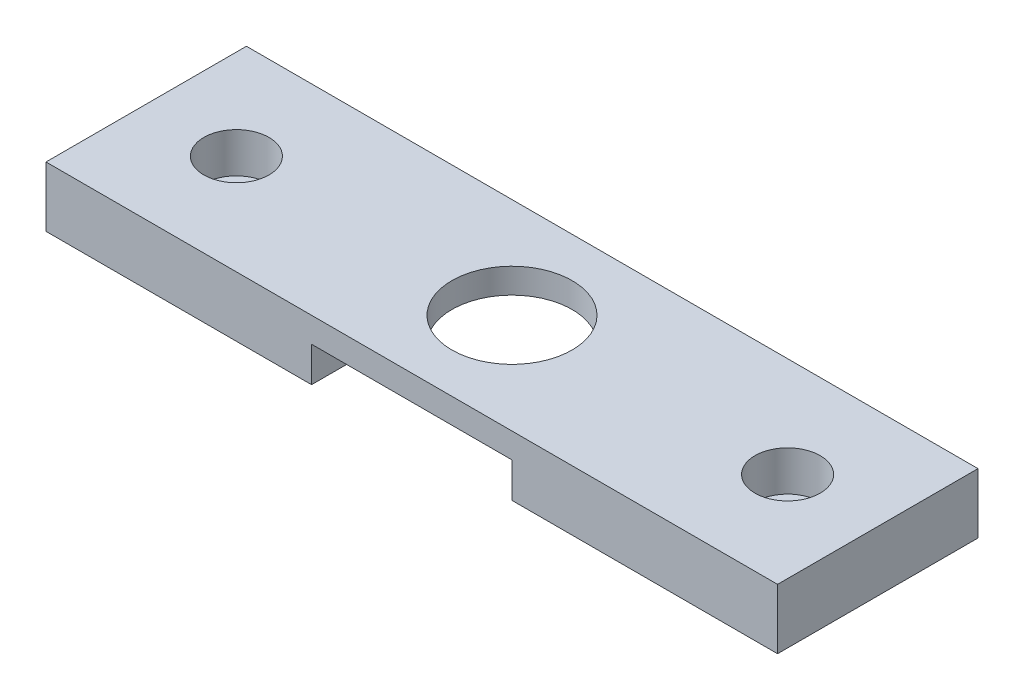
ISO-10303-21;
HEADER;
FILE_DESCRIPTION(('STEP AP214'),'2;1');
FILE_NAME('part.step','',(''),(''),'','','');
FILE_SCHEMA(('AUTOMOTIVE_DESIGN { 1 0 10303 214 1 1 1 1 }'));
ENDSEC;
DATA;
#1=APPLICATION_CONTEXT('core data for automotive mechanical design processes');
#2=APPLICATION_PROTOCOL_DEFINITION('international standard','automotive_design',2000,#1);
#3=PRODUCT_CONTEXT('',#1,'mechanical');
#4=PRODUCT('Part','Part','',(#3));
#5=PRODUCT_RELATED_PRODUCT_CATEGORY('part','',(#4));
#6=PRODUCT_DEFINITION_FORMATION('','',#4);
#7=PRODUCT_DEFINITION_CONTEXT('part definition',#1,'design');
#8=PRODUCT_DEFINITION('design','',#6,#7);
#9=PRODUCT_DEFINITION_SHAPE('','',#8);
#10=(LENGTH_UNIT() NAMED_UNIT(*) SI_UNIT(.MILLI.,.METRE.));
#11=(NAMED_UNIT(*) PLANE_ANGLE_UNIT() SI_UNIT($,.RADIAN.));
#12=(NAMED_UNIT(*) SI_UNIT($,.STERADIAN.) SOLID_ANGLE_UNIT());
#13=UNCERTAINTY_MEASURE_WITH_UNIT(LENGTH_MEASURE(1.E-05),#10,'distance_accuracy_value','');
#14=(GEOMETRIC_REPRESENTATION_CONTEXT(3) GLOBAL_UNCERTAINTY_ASSIGNED_CONTEXT((#13)) GLOBAL_UNIT_ASSIGNED_CONTEXT((#10,
#11,#12)) REPRESENTATION_CONTEXT('',''));
#15=CARTESIAN_POINT('',(0.,0.,0.));
#16=DIRECTION('',(0.,0.,1.));
#17=DIRECTION('',(1.,0.,0.));
#18=AXIS2_PLACEMENT_3D('',#15,#16,#17);
#19=CARTESIAN_POINT('',(-55.,12.,0.));
#20=DIRECTION('',(0.,1.,0.));
#21=DIRECTION('',(0.,0.,1.));
#22=AXIS2_PLACEMENT_3D('',#19,#20,#21);
#23=CYLINDRICAL_SURFACE('',#22,4.2);
#24=CARTESIAN_POINT('',(-55.,0.,0.));
#25=DIRECTION('',(0.,1.,0.));
#26=DIRECTION('',(0.,0.,1.));
#27=AXIS2_PLACEMENT_3D('',#24,#25,#26);
#28=CIRCLE('',#27,4.2);
#29=CARTESIAN_POINT('',(-55.,0.,4.2));
#30=VERTEX_POINT('',#29);
#31=EDGE_CURVE('E126',#30,#30,#28,.F.);
#32=ORIENTED_EDGE('',*,*,#31,.T.);
#33=EDGE_LOOP('',(#32));
#34=FACE_BOUND('',#33,.T.);
#35=CARTESIAN_POINT('',(-55.,4.,0.));
#36=DIRECTION('',(0.,1.,0.));
#37=DIRECTION('',(0.,0.,1.));
#38=AXIS2_PLACEMENT_3D('',#35,#36,#37);
#39=CIRCLE('',#38,4.2);
#40=CARTESIAN_POINT('',(-55.,4.,4.2));
#41=VERTEX_POINT('',#40);
#42=EDGE_CURVE('E20',#41,#41,#39,.T.);
#43=ORIENTED_EDGE('',*,*,#42,.T.);
#44=EDGE_LOOP('',(#43));
#45=FACE_BOUND('',#44,.T.);
#46=ADVANCED_FACE('F17',(#34,#45),#23,.F.);
#47=CARTESIAN_POINT('',(55.,12.,0.));
#48=DIRECTION('',(0.,1.,0.));
#49=DIRECTION('',(0.,0.,1.));
#50=AXIS2_PLACEMENT_3D('',#47,#48,#49);
#51=CYLINDRICAL_SURFACE('',#50,4.2);
#52=CARTESIAN_POINT('',(55.,0.,0.));
#53=DIRECTION('',(0.,1.,0.));
#54=DIRECTION('',(0.,0.,1.));
#55=AXIS2_PLACEMENT_3D('',#52,#53,#54);
#56=CIRCLE('',#55,4.2);
#57=CARTESIAN_POINT('',(55.,0.,4.2));
#58=VERTEX_POINT('',#57);
#59=EDGE_CURVE('E124',#58,#58,#56,.F.);
#60=ORIENTED_EDGE('',*,*,#59,.T.);
#61=EDGE_LOOP('',(#60));
#62=FACE_BOUND('',#61,.T.);
#63=CARTESIAN_POINT('',(55.,4.,0.));
#64=DIRECTION('',(0.,1.,0.));
#65=DIRECTION('',(0.,0.,1.));
#66=AXIS2_PLACEMENT_3D('',#63,#64,#65);
#67=CIRCLE('',#66,4.2);
#68=CARTESIAN_POINT('',(55.,4.,4.2));
#69=VERTEX_POINT('',#68);
#70=EDGE_CURVE('E148',#69,#69,#67,.T.);
#71=ORIENTED_EDGE('',*,*,#70,.T.);
#72=EDGE_LOOP('',(#71));
#73=FACE_BOUND('',#72,.T.);
#74=ADVANCED_FACE('F159',(#62,#73),#51,.F.);
#75=CARTESIAN_POINT('',(-50.8,4.,0.));
#76=DIRECTION('',(0.,-1.,0.));
#77=DIRECTION('',(0.,0.,-1.));
#78=AXIS2_PLACEMENT_3D('',#75,#76,#77);
#79=PLANE('',#78);
#80=CARTESIAN_POINT('',(-55.,4.,0.));
#81=DIRECTION('',(0.,1.,0.));
#82=DIRECTION('',(0.,0.,1.));
#83=AXIS2_PLACEMENT_3D('',#80,#81,#82);
#84=CIRCLE('',#83,6.5);
#85=CARTESIAN_POINT('',(-55.,4.,6.50000000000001));
#86=VERTEX_POINT('',#85);
#87=EDGE_CURVE('E140',#86,#86,#84,.T.);
#88=ORIENTED_EDGE('',*,*,#87,.T.);
#89=EDGE_LOOP('',(#88));
#90=FACE_BOUND('',#89,.T.);
#91=ORIENTED_EDGE('',*,*,#42,.F.);
#92=EDGE_LOOP('',(#91));
#93=FACE_BOUND('',#92,.T.);
#94=ADVANCED_FACE('F156',(#90,#93),#79,.F.);
#95=CARTESIAN_POINT('',(59.2,4.,0.));
#96=DIRECTION('',(0.,-1.,0.));
#97=DIRECTION('',(0.,0.,-1.));
#98=AXIS2_PLACEMENT_3D('',#95,#96,#97);
#99=PLANE('',#98);
#100=CARTESIAN_POINT('',(55.,4.,0.));
#101=DIRECTION('',(0.,1.,0.));
#102=DIRECTION('',(0.,0.,1.));
#103=AXIS2_PLACEMENT_3D('',#100,#101,#102);
#104=CIRCLE('',#103,6.5);
#105=CARTESIAN_POINT('',(55.,4.,6.50000000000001));
#106=VERTEX_POINT('',#105);
#107=EDGE_CURVE('E94',#106,#106,#104,.T.);
#108=ORIENTED_EDGE('',*,*,#107,.T.);
#109=EDGE_LOOP('',(#108));
#110=FACE_BOUND('',#109,.T.);
#111=ORIENTED_EDGE('',*,*,#70,.F.);
#112=EDGE_LOOP('',(#111));
#113=FACE_BOUND('',#112,.T.);
#114=ADVANCED_FACE('F158',(#110,#113),#99,.F.);
#115=CARTESIAN_POINT('',(-20.,-7.,-20.));
#116=DIRECTION('',(-1.,0.,0.));
#117=DIRECTION('',(0.,0.,1.));
#118=AXIS2_PLACEMENT_3D('',#115,#116,#117);
#119=PLANE('',#118);
#120=DIRECTION('',(0.,0.,1.));
#121=VECTOR('',#120,1.);
#122=CARTESIAN_POINT('',(-20.,7.,-20.));
#123=LINE('',#122,#121);
#124=CARTESIAN_POINT('',(-20.,7.,-20.));
#125=VERTEX_POINT('',#124);
#126=CARTESIAN_POINT('',(-20.,7.,20.));
#127=VERTEX_POINT('',#126);
#128=EDGE_CURVE('E118',#125,#127,#123,.T.);
#129=ORIENTED_EDGE('',*,*,#128,.T.);
#130=DIRECTION('',(0.,1.,0.));
#131=VECTOR('',#130,1.);
#132=CARTESIAN_POINT('',(-20.,12.,20.));
#133=LINE('',#132,#131);
#134=CARTESIAN_POINT('',(-20.,0.,20.));
#135=VERTEX_POINT('',#134);
#136=EDGE_CURVE('E223',#127,#135,#133,.F.);
#137=ORIENTED_EDGE('',*,*,#136,.T.);
#138=DIRECTION('',(0.,0.,1.));
#139=VECTOR('',#138,1.);
#140=CARTESIAN_POINT('',(-20.,0.,0.));
#141=LINE('',#140,#139);
#142=CARTESIAN_POINT('',(-20.,0.,-20.));
#143=VERTEX_POINT('',#142);
#144=EDGE_CURVE('E79',#135,#143,#141,.F.);
#145=ORIENTED_EDGE('',*,*,#144,.T.);
#146=DIRECTION('',(0.,1.,0.));
#147=VECTOR('',#146,1.);
#148=CARTESIAN_POINT('',(-20.,12.,-20.));
#149=LINE('',#148,#147);
#150=EDGE_CURVE('E114',#143,#125,#149,.T.);
#151=ORIENTED_EDGE('',*,*,#150,.T.);
#152=EDGE_LOOP('',(#129,#137,#145,#151));
#153=FACE_BOUND('',#152,.T.);
#154=ADVANCED_FACE('F167',(#153),#119,.F.);
#155=CARTESIAN_POINT('',(0.,0.,0.));
#156=DIRECTION('',(0.,1.,0.));
#157=DIRECTION('',(0.,0.,1.));
#158=AXIS2_PLACEMENT_3D('',#155,#156,#157);
#159=PLANE('',#158);
#160=ORIENTED_EDGE('',*,*,#144,.F.);
#161=DIRECTION('',(-1.,0.,0.));
#162=VECTOR('',#161,1.);
#163=CARTESIAN_POINT('',(-73.,0.,20.));
#164=LINE('',#163,#162);
#165=CARTESIAN_POINT('',(-73.,0.,20.));
#166=VERTEX_POINT('',#165);
#167=EDGE_CURVE('E234',#135,#166,#164,.T.);
#168=ORIENTED_EDGE('',*,*,#167,.T.);
#169=DIRECTION('',(0.,0.,-1.));
#170=VECTOR('',#169,1.);
#171=CARTESIAN_POINT('',(-73.,0.,-20.));
#172=LINE('',#171,#170);
#173=CARTESIAN_POINT('',(-73.,0.,-20.));
#174=VERTEX_POINT('',#173);
#175=EDGE_CURVE('E235',#166,#174,#172,.T.);
#176=ORIENTED_EDGE('',*,*,#175,.T.);
#177=DIRECTION('',(1.,0.,0.));
#178=VECTOR('',#177,1.);
#179=CARTESIAN_POINT('',(-73.,0.,-20.));
#180=LINE('',#179,#178);
#181=EDGE_CURVE('E112',#174,#143,#180,.T.);
#182=ORIENTED_EDGE('',*,*,#181,.T.);
#183=EDGE_LOOP('',(#160,#168,#176,#182));
#184=FACE_BOUND('',#183,.T.);
#185=ORIENTED_EDGE('',*,*,#31,.F.);
#186=EDGE_LOOP('',(#185));
#187=FACE_BOUND('',#186,.T.);
#188=ADVANCED_FACE('F213',(#184,#187),#159,.F.);
#189=CARTESIAN_POINT('',(0.,0.,0.));
#190=DIRECTION('',(0.,1.,0.));
#191=DIRECTION('',(0.,0.,1.));
#192=AXIS2_PLACEMENT_3D('',#189,#190,#191);
#193=PLANE('',#192);
#194=DIRECTION('',(0.,0.,-1.));
#195=VECTOR('',#194,1.);
#196=CARTESIAN_POINT('',(20.,0.,-20.));
#197=LINE('',#196,#195);
#198=CARTESIAN_POINT('',(20.,0.,20.));
#199=VERTEX_POINT('',#198);
#200=CARTESIAN_POINT('',(20.,0.,-20.));
#201=VERTEX_POINT('',#200);
#202=EDGE_CURVE('E101',#199,#201,#197,.T.);
#203=ORIENTED_EDGE('',*,*,#202,.T.);
#204=DIRECTION('',(1.,0.,0.));
#205=VECTOR('',#204,1.);
#206=CARTESIAN_POINT('',(-73.,0.,-20.));
#207=LINE('',#206,#205);
#208=CARTESIAN_POINT('',(73.,0.,-20.));
#209=VERTEX_POINT('',#208);
#210=EDGE_CURVE('E97',#201,#209,#207,.T.);
#211=ORIENTED_EDGE('',*,*,#210,.T.);
#212=DIRECTION('',(0.,0.,1.));
#213=VECTOR('',#212,1.);
#214=CARTESIAN_POINT('',(73.,0.,-20.));
#215=LINE('',#214,#213);
#216=CARTESIAN_POINT('',(73.,0.,20.));
#217=VERTEX_POINT('',#216);
#218=EDGE_CURVE('E84',#209,#217,#215,.T.);
#219=ORIENTED_EDGE('',*,*,#218,.T.);
#220=DIRECTION('',(-1.,0.,0.));
#221=VECTOR('',#220,1.);
#222=CARTESIAN_POINT('',(-73.,0.,20.));
#223=LINE('',#222,#221);
#224=EDGE_CURVE('E245',#217,#199,#223,.T.);
#225=ORIENTED_EDGE('',*,*,#224,.T.);
#226=EDGE_LOOP('',(#203,#211,#219,#225));
#227=FACE_BOUND('',#226,.T.);
#228=ORIENTED_EDGE('',*,*,#59,.F.);
#229=EDGE_LOOP('',(#228));
#230=FACE_BOUND('',#229,.T.);
#231=ADVANCED_FACE('F98',(#227,#230),#193,.F.);
#232=CARTESIAN_POINT('',(20.,-7.,-20.));
#233=DIRECTION('',(1.,0.,0.));
#234=DIRECTION('',(0.,0.,-1.));
#235=AXIS2_PLACEMENT_3D('',#232,#233,#234);
#236=PLANE('',#235);
#237=DIRECTION('',(0.,0.,1.));
#238=VECTOR('',#237,1.);
#239=CARTESIAN_POINT('',(20.,7.,-20.));
#240=LINE('',#239,#238);
#241=CARTESIAN_POINT('',(20.,7.,20.));
#242=VERTEX_POINT('',#241);
#243=CARTESIAN_POINT('',(20.,7.,-20.));
#244=VERTEX_POINT('',#243);
#245=EDGE_CURVE('E121',#242,#244,#240,.F.);
#246=ORIENTED_EDGE('',*,*,#245,.T.);
#247=DIRECTION('',(0.,1.,0.));
#248=VECTOR('',#247,1.);
#249=CARTESIAN_POINT('',(20.,12.,-20.));
#250=LINE('',#249,#248);
#251=EDGE_CURVE('E106',#244,#201,#250,.F.);
#252=ORIENTED_EDGE('',*,*,#251,.T.);
#253=ORIENTED_EDGE('',*,*,#202,.F.);
#254=DIRECTION('',(0.,1.,0.));
#255=VECTOR('',#254,1.);
#256=CARTESIAN_POINT('',(20.,12.,20.));
#257=LINE('',#256,#255);
#258=EDGE_CURVE('E231',#199,#242,#257,.T.);
#259=ORIENTED_EDGE('',*,*,#258,.T.);
#260=EDGE_LOOP('',(#246,#252,#253,#259));
#261=FACE_BOUND('',#260,.T.);
#262=ADVANCED_FACE('F206',(#261),#236,.F.);
#263=CARTESIAN_POINT('',(-20.,7.,-20.));
#264=DIRECTION('',(0.,1.,0.));
#265=DIRECTION('',(0.,0.,1.));
#266=AXIS2_PLACEMENT_3D('',#263,#264,#265);
#267=PLANE('',#266);
#268=CARTESIAN_POINT('',(0.,7.,0.));
#269=DIRECTION('',(0.,1.,0.));
#270=DIRECTION('',(0.,0.,1.));
#271=AXIS2_PLACEMENT_3D('',#268,#269,#270);
#272=CIRCLE('',#271,12.);
#273=CARTESIAN_POINT('',(0.,7.,12.));
#274=VERTEX_POINT('',#273);
#275=EDGE_CURVE('E120',#274,#274,#272,.T.);
#276=ORIENTED_EDGE('',*,*,#275,.T.);
#277=EDGE_LOOP('',(#276));
#278=FACE_BOUND('',#277,.T.);
#279=ORIENTED_EDGE('',*,*,#128,.F.);
#280=DIRECTION('',(1.,0.,0.));
#281=VECTOR('',#280,1.);
#282=CARTESIAN_POINT('',(-73.,7.,-20.));
#283=LINE('',#282,#281);
#284=EDGE_CURVE('E244',#125,#244,#283,.T.);
#285=ORIENTED_EDGE('',*,*,#284,.T.);
#286=ORIENTED_EDGE('',*,*,#245,.F.);
#287=DIRECTION('',(-1.,0.,0.));
#288=VECTOR('',#287,1.);
#289=CARTESIAN_POINT('',(-73.,7.,20.));
#290=LINE('',#289,#288);
#291=EDGE_CURVE('E137',#242,#127,#290,.T.);
#292=ORIENTED_EDGE('',*,*,#291,.T.);
#293=EDGE_LOOP('',(#279,#285,#286,#292));
#294=FACE_BOUND('',#293,.T.);
#295=ADVANCED_FACE('F202',(#278,#294),#267,.F.);
#296=CARTESIAN_POINT('',(0.,0.,0.));
#297=DIRECTION('',(0.,1.,0.));
#298=DIRECTION('',(0.,0.,1.));
#299=AXIS2_PLACEMENT_3D('',#296,#297,#298);
#300=CYLINDRICAL_SURFACE('',#299,12.);
#301=CARTESIAN_POINT('',(0.,12.,0.));
#302=DIRECTION('',(0.,1.,0.));
#303=DIRECTION('',(0.,0.,1.));
#304=AXIS2_PLACEMENT_3D('',#301,#302,#303);
#305=CIRCLE('',#304,12.);
#306=CARTESIAN_POINT('',(0.,12.,12.));
#307=VERTEX_POINT('',#306);
#308=EDGE_CURVE('E134',#307,#307,#305,.F.);
#309=ORIENTED_EDGE('',*,*,#308,.F.);
#310=EDGE_LOOP('',(#309));
#311=FACE_BOUND('',#310,.T.);
#312=ORIENTED_EDGE('',*,*,#275,.F.);
#313=EDGE_LOOP('',(#312));
#314=FACE_BOUND('',#313,.T.);
#315=ADVANCED_FACE('F198',(#311,#314),#300,.F.);
#316=CARTESIAN_POINT('',(-55.,12.,0.));
#317=DIRECTION('',(0.,1.,0.));
#318=DIRECTION('',(0.,0.,1.));
#319=AXIS2_PLACEMENT_3D('',#316,#317,#318);
#320=CYLINDRICAL_SURFACE('',#319,6.5);
#321=CARTESIAN_POINT('',(-55.,12.,0.));
#322=DIRECTION('',(0.,1.,0.));
#323=DIRECTION('',(0.,0.,1.));
#324=AXIS2_PLACEMENT_3D('',#321,#322,#323);
#325=CIRCLE('',#324,6.5);
#326=CARTESIAN_POINT('',(-55.,12.,6.50000000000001));
#327=VERTEX_POINT('',#326);
#328=EDGE_CURVE('E131',#327,#327,#325,.F.);
#329=ORIENTED_EDGE('',*,*,#328,.F.);
#330=EDGE_LOOP('',(#329));
#331=FACE_BOUND('',#330,.T.);
#332=ORIENTED_EDGE('',*,*,#87,.F.);
#333=EDGE_LOOP('',(#332));
#334=FACE_BOUND('',#333,.T.);
#335=ADVANCED_FACE('F194',(#331,#334),#320,.F.);
#336=CARTESIAN_POINT('',(55.,12.,0.));
#337=DIRECTION('',(0.,1.,0.));
#338=DIRECTION('',(0.,0.,1.));
#339=AXIS2_PLACEMENT_3D('',#336,#337,#338);
#340=CYLINDRICAL_SURFACE('',#339,6.5);
#341=CARTESIAN_POINT('',(55.,12.,0.));
#342=DIRECTION('',(0.,1.,0.));
#343=DIRECTION('',(0.,0.,1.));
#344=AXIS2_PLACEMENT_3D('',#341,#342,#343);
#345=CIRCLE('',#344,6.5);
#346=CARTESIAN_POINT('',(55.,12.,6.50000000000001));
#347=VERTEX_POINT('',#346);
#348=EDGE_CURVE('E127',#347,#347,#345,.F.);
#349=ORIENTED_EDGE('',*,*,#348,.F.);
#350=EDGE_LOOP('',(#349));
#351=FACE_BOUND('',#350,.T.);
#352=ORIENTED_EDGE('',*,*,#107,.F.);
#353=EDGE_LOOP('',(#352));
#354=FACE_BOUND('',#353,.T.);
#355=ADVANCED_FACE('F191',(#351,#354),#340,.F.);
#356=CARTESIAN_POINT('',(73.,12.,-20.));
#357=DIRECTION('',(-1.,0.,0.));
#358=DIRECTION('',(0.,0.,1.));
#359=AXIS2_PLACEMENT_3D('',#356,#357,#358);
#360=PLANE('',#359);
#361=DIRECTION('',(0.,1.,0.));
#362=VECTOR('',#361,1.);
#363=CARTESIAN_POINT('',(73.,12.,-20.));
#364=LINE('',#363,#362);
#365=CARTESIAN_POINT('',(73.,12.,-20.));
#366=VERTEX_POINT('',#365);
#367=EDGE_CURVE('E88',#209,#366,#364,.T.);
#368=ORIENTED_EDGE('',*,*,#367,.T.);
#369=DIRECTION('',(0.,0.,1.));
#370=VECTOR('',#369,1.);
#371=CARTESIAN_POINT('',(73.,12.,0.));
#372=LINE('',#371,#370);
#373=CARTESIAN_POINT('',(73.,12.,20.));
#374=VERTEX_POINT('',#373);
#375=EDGE_CURVE('E130',#374,#366,#372,.F.);
#376=ORIENTED_EDGE('',*,*,#375,.F.);
#377=DIRECTION('',(0.,1.,0.));
#378=VECTOR('',#377,1.);
#379=CARTESIAN_POINT('',(73.,12.,20.));
#380=LINE('',#379,#378);
#381=EDGE_CURVE('E91',#374,#217,#380,.F.);
#382=ORIENTED_EDGE('',*,*,#381,.T.);
#383=ORIENTED_EDGE('',*,*,#218,.F.);
#384=EDGE_LOOP('',(#368,#376,#382,#383));
#385=FACE_BOUND('',#384,.T.);
#386=ADVANCED_FACE('F86',(#385),#360,.F.);
#387=CARTESIAN_POINT('',(-73.,12.,-20.));
#388=DIRECTION('',(0.,0.,1.));
#389=DIRECTION('',(1.,0.,0.));
#390=AXIS2_PLACEMENT_3D('',#387,#388,#389);
#391=PLANE('',#390);
#392=ORIENTED_EDGE('',*,*,#251,.F.);
#393=ORIENTED_EDGE('',*,*,#284,.F.);
#394=ORIENTED_EDGE('',*,*,#150,.F.);
#395=ORIENTED_EDGE('',*,*,#181,.F.);
#396=DIRECTION('',(0.,1.,0.));
#397=VECTOR('',#396,1.);
#398=CARTESIAN_POINT('',(-73.,12.,-20.));
#399=LINE('',#398,#397);
#400=CARTESIAN_POINT('',(-73.,12.,-20.));
#401=VERTEX_POINT('',#400);
#402=EDGE_CURVE('E105',#174,#401,#399,.T.);
#403=ORIENTED_EDGE('',*,*,#402,.T.);
#404=DIRECTION('',(1.,0.,0.));
#405=VECTOR('',#404,1.);
#406=CARTESIAN_POINT('',(0.,12.,-20.));
#407=LINE('',#406,#405);
#408=EDGE_CURVE('E110',#366,#401,#407,.F.);
#409=ORIENTED_EDGE('',*,*,#408,.F.);
#410=ORIENTED_EDGE('',*,*,#367,.F.);
#411=ORIENTED_EDGE('',*,*,#210,.F.);
#412=EDGE_LOOP('',(#392,#393,#394,#395,#403,#409,#410,#411));
#413=FACE_BOUND('',#412,.T.);
#414=ADVANCED_FACE('F108',(#413),#391,.F.);
#415=CARTESIAN_POINT('',(-73.,12.,-20.));
#416=DIRECTION('',(1.,0.,0.));
#417=DIRECTION('',(0.,0.,-1.));
#418=AXIS2_PLACEMENT_3D('',#415,#416,#417);
#419=PLANE('',#418);
#420=DIRECTION('',(0.,1.,0.));
#421=VECTOR('',#420,1.);
#422=CARTESIAN_POINT('',(-73.,12.,20.));
#423=LINE('',#422,#421);
#424=CARTESIAN_POINT('',(-73.,12.,20.));
#425=VERTEX_POINT('',#424);
#426=EDGE_CURVE('E35',#166,#425,#423,.T.);
#427=ORIENTED_EDGE('',*,*,#426,.T.);
#428=DIRECTION('',(0.,0.,1.));
#429=VECTOR('',#428,1.);
#430=CARTESIAN_POINT('',(-73.,12.,0.));
#431=LINE('',#430,#429);
#432=EDGE_CURVE('E26',#401,#425,#431,.T.);
#433=ORIENTED_EDGE('',*,*,#432,.F.);
#434=ORIENTED_EDGE('',*,*,#402,.F.);
#435=ORIENTED_EDGE('',*,*,#175,.F.);
#436=EDGE_LOOP('',(#427,#433,#434,#435));
#437=FACE_BOUND('',#436,.T.);
#438=ADVANCED_FACE('F179',(#437),#419,.F.);
#439=CARTESIAN_POINT('',(-73.,12.,20.));
#440=DIRECTION('',(0.,0.,-1.));
#441=DIRECTION('',(-1.,0.,0.));
#442=AXIS2_PLACEMENT_3D('',#439,#440,#441);
#443=PLANE('',#442);
#444=ORIENTED_EDGE('',*,*,#258,.F.);
#445=ORIENTED_EDGE('',*,*,#224,.F.);
#446=ORIENTED_EDGE('',*,*,#381,.F.);
#447=DIRECTION('',(1.,0.,0.));
#448=VECTOR('',#447,1.);
#449=CARTESIAN_POINT('',(0.,12.,20.));
#450=LINE('',#449,#448);
#451=EDGE_CURVE('E11',#425,#374,#450,.T.);
#452=ORIENTED_EDGE('',*,*,#451,.F.);
#453=ORIENTED_EDGE('',*,*,#426,.F.);
#454=ORIENTED_EDGE('',*,*,#167,.F.);
#455=ORIENTED_EDGE('',*,*,#136,.F.);
#456=ORIENTED_EDGE('',*,*,#291,.F.);
#457=EDGE_LOOP('',(#444,#445,#446,#452,#453,#454,#455,#456));
#458=FACE_BOUND('',#457,.T.);
#459=ADVANCED_FACE('F173',(#458),#443,.F.);
#460=CARTESIAN_POINT('',(0.,12.,0.));
#461=DIRECTION('',(0.,1.,0.));
#462=DIRECTION('',(0.,0.,1.));
#463=AXIS2_PLACEMENT_3D('',#460,#461,#462);
#464=PLANE('',#463);
#465=ORIENTED_EDGE('',*,*,#432,.T.);
#466=ORIENTED_EDGE('',*,*,#451,.T.);
#467=ORIENTED_EDGE('',*,*,#375,.T.);
#468=ORIENTED_EDGE('',*,*,#408,.T.);
#469=EDGE_LOOP('',(#465,#466,#467,#468));
#470=FACE_BOUND('',#469,.T.);
#471=ORIENTED_EDGE('',*,*,#348,.T.);
#472=EDGE_LOOP('',(#471));
#473=FACE_BOUND('',#472,.T.);
#474=ORIENTED_EDGE('',*,*,#328,.T.);
#475=EDGE_LOOP('',(#474));
#476=FACE_BOUND('',#475,.T.);
#477=ORIENTED_EDGE('',*,*,#308,.T.);
#478=EDGE_LOOP('',(#477));
#479=FACE_BOUND('',#478,.T.);
#480=ADVANCED_FACE('F171',(#470,#473,#476,#479),#464,.T.);
#481=CLOSED_SHELL('',(#46,#74,#94,#114,#154,#188,#231,#262,#295,#315,#335,#355,#386,#414,#438,
#459,#480));
#482=MANIFOLD_SOLID_BREP('B1',#481);
#483=ADVANCED_BREP_SHAPE_REPRESENTATION('',(#18,#482),#14);
#484=SHAPE_DEFINITION_REPRESENTATION(#9,#483);
ENDSEC;
END-ISO-10303-21;
